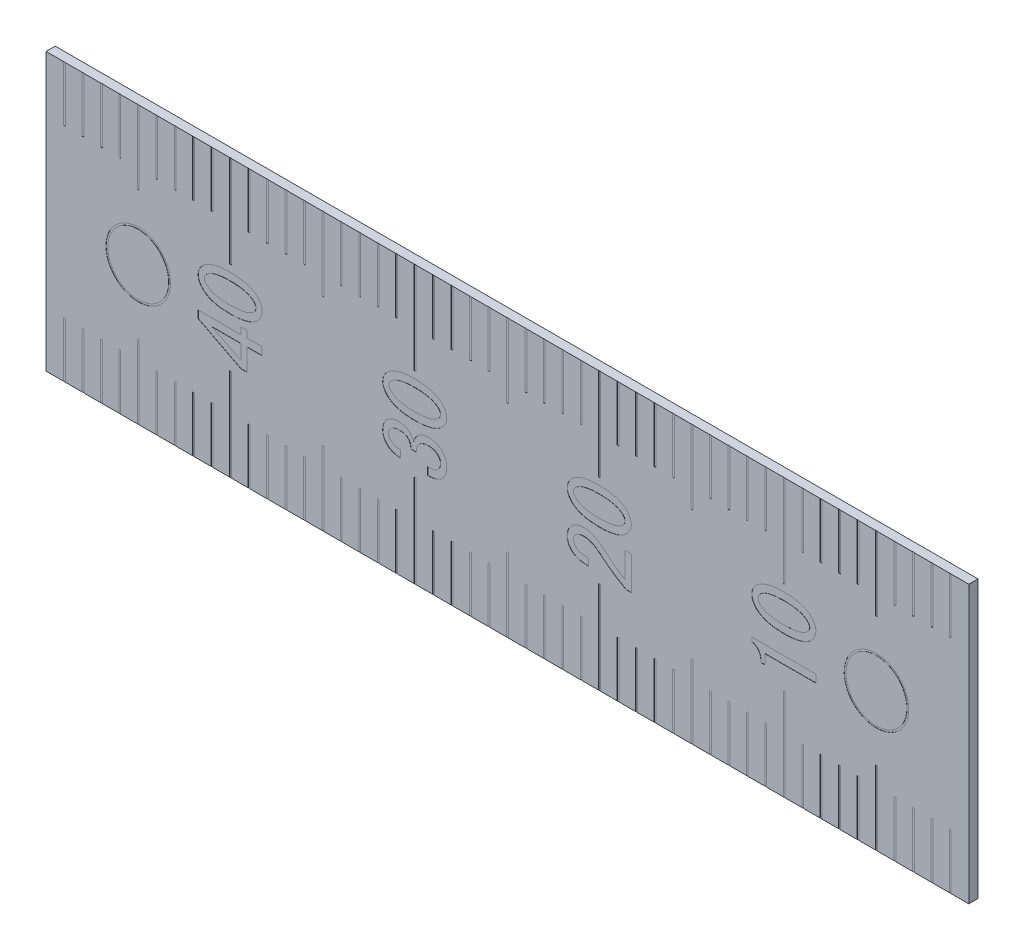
from build123d import *

# Parameters (mm, degrees)
SKETCH1_W             = 15
SKETCH1_H             = 50
EXTRUDE1_DEPTH        = 0.5
SKETCH2_R             = 1.75
SKETCH2_R_2           = 1.65
EXTRUDE2_DEPTH        = 0.01
EXTRUDE3_DEPTH        = 0.01
SKETCH4_W             = 5
SKETCH4_H             = 0.1
SKETCH4_W_2           = 3
SKETCH4_W_3           = 4
EXTRUDE4_DEPTH        = 0.01
BODY_MOVE_COPY2_ANGLE = 90


with BuildPart() as part:
    # Sketch1 → Extrude1 (new body)
    with BuildSketch(Plane.XY):
        with Locations((7.5, 25)):
            Rectangle(SKETCH1_W, SKETCH1_H)
    extrude(amount=EXTRUDE1_DEPTH)

    # Sketch2 → Extrude2 (cut)
    # profile 1 of 2: a face of its own
    with BuildSketch(Plane.XY.offset(0.5)):
        with Locations((7.5, 5)):
            Circle(SKETCH2_R)
        with Locations((7.5, 5)):
            Circle(SKETCH2_R_2, mode=Mode.SUBTRACT)
    # profile 2 of 2: a face of its own
    with BuildSketch(Plane.XY.offset(0.5)):
        with Locations((7.5, 45)):
            Circle(SKETCH2_R)
        with Locations((7.5, 45)):
            Circle(SKETCH2_R_2, mode=Mode.SUBTRACT)
    extrude(amount=-EXTRUDE2_DEPTH, mode=Mode.SUBTRACT)

    # Sketch3 → Extrude3 (cut)
    # profile 1 of 8: a face of its own
    with BuildSketch(Plane.XY.offset(0.5)):
        Polygon((6.572881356, 38.286911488), (6.572881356, 38.694915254), (6.572881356, 39.105555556), (5.392372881, 39.105555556), (5.392372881, 39.442372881), (6.584745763, 41.755932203), (6.994067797, 41.755932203), (6.994067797, 39.442372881), (7.36779661, 39.442372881), (7.36779661, 39.105555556), (6.994067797, 39.105555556), (6.994067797, 38.286911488), align=None)
        Polygon((6.572881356, 39.442372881), (6.572881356, 41.008474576), (5.783898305, 39.442372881), align=None, mode=Mode.SUBTRACT)
    # profile 2 of 8: a face of its own
    with BuildSketch(Plane.XY.offset(0.5)):
        with BuildLine():
            add(Edge.make_bspline(
                [(7.670338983, 40.029661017), (7.670829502, 40.072507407), (7.671793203, 40.156685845), (7.676090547, 40.280686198), (7.684705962, 40.399825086), (7.696795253, 40.514071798), (7.710795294, 40.623684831), (7.729370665, 40.728309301), (7.751095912, 40.828149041), (7.77597959, 40.922993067), (7.804365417, 41.012966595), (7.836057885, 41.098089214), (7.870573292, 41.178755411), (7.909950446, 41.253817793), (7.951116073, 41.324637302), (7.996213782, 41.390336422), (8.044897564, 41.450979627), (8.080073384, 41.488323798), (8.097457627, 41.506779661)],
                knots=[0, 0, 0, 0, 1.305427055, 2.564715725, 3.779397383, 4.943659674, 6.064530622, 7.145206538, 8.1798118, 9.17670212, 10.131464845, 11.052792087, 11.943155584, 12.802378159, 13.633530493, 14.437472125, 15.227783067, 16, 16, 16, 16], degree=3))
            add(Edge.make_bspline(
                [(8.097457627, 41.506779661), (8.118189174, 41.526742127), (8.158560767, 41.565616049), (8.223990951, 41.6159742), (8.29062965, 41.658865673), (8.358609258, 41.695138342), (8.429073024, 41.722269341), (8.501187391, 41.741138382), (8.574673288, 41.753722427), (8.624274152, 41.755194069), (8.649152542, 41.755932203)],
                knots=[0, 0, 0, 0, 1.110117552, 2.161788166, 3.18031983, 4.16653166, 5.130321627, 6.086809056, 7.040397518, 8, 8, 8, 8], degree=3))
            add(Edge.make_bspline(
                [(8.649152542, 41.755932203), (8.674030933, 41.755194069), (8.723631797, 41.753722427), (8.797117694, 41.741138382), (8.869232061, 41.722269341), (8.939695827, 41.695138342), (9.007675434, 41.658865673), (9.074314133, 41.6159742), (9.139744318, 41.565616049), (9.18011591, 41.526742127), (9.200847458, 41.506779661)],
                knots=[0, 0, 0, 0, 0.959602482, 1.913190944, 2.869678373, 3.83346834, 4.81968017, 5.838211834, 6.889882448, 8, 8, 8, 8], degree=3))
            add(Edge.make_bspline(
                [(9.200847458, 41.506779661), (9.218227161, 41.488321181), (9.253393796, 41.450971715), (9.302148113, 41.39036917), (9.347032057, 41.324417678), (9.389280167, 41.254207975), (9.427522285, 41.17853116), (9.462317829, 41.098126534), (9.493918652, 41.012955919), (9.522335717, 40.922996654), (9.547189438, 40.828145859), (9.569006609, 40.728318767), (9.587229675, 40.623619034), (9.602638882, 40.514179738), (9.613279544, 40.399768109), (9.622305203, 40.280696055), (9.626487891, 40.156683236), (9.62746749, 40.072506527), (9.627966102, 40.029661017)],
                knots=[0, 0, 0, 0, 0.772188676, 1.562470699, 2.366382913, 3.20092084, 4.057056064, 4.947386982, 5.868680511, 6.823408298, 7.82026214, 8.854829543, 9.935465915, 11.057194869, 12.220740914, 13.435378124, 14.694620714, 16, 16, 16, 16], degree=3))
            add(Edge.make_bspline(
                [(9.627966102, 40.029661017), (9.627467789, 39.985936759), (9.62649093, 39.900222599), (9.622328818, 39.774232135), (9.613247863, 39.653405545), (9.602616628, 39.537241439), (9.587362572, 39.426237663), (9.568912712, 39.320259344), (9.547201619, 39.219315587), (9.522309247, 39.123160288), (9.494041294, 39.032051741), (9.462303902, 38.946046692), (9.427521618, 38.864982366), (9.389289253, 38.788641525), (9.347004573, 38.717800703), (9.302346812, 38.651238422), (9.253373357, 38.590568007), (9.218220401, 38.553208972), (9.200847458, 38.534745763)],
                knots=[0, 0, 0, 0, 1.317726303, 2.583183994, 3.797878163, 4.968595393, 6.097857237, 7.173314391, 8.20962062, 9.208490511, 10.165515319, 11.083041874, 11.969809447, 12.822581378, 13.653772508, 14.454446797, 15.23617212, 16, 16, 16, 16], degree=3))
            add(Edge.make_bspline(
                [(9.200847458, 38.534745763), (9.180085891, 38.515033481), (9.139553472, 38.476549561), (9.074305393, 38.426244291), (9.007859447, 38.383179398), (8.939507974, 38.347848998), (8.869256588, 38.320526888), (8.797111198, 38.30171788), (8.723633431, 38.289118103), (8.674031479, 38.287648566), (8.649152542, 38.286911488)],
                knots=[0, 0, 0, 0, 1.105704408, 2.15864601, 3.178408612, 4.161898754, 5.126853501, 6.084496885, 7.039237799, 8, 8, 8, 8], degree=3))
            add(Edge.make_bspline(
                [(8.649152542, 38.286911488), (8.624273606, 38.287648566), (8.574671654, 38.289118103), (8.501193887, 38.30171788), (8.429048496, 38.320526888), (8.358797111, 38.347848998), (8.290445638, 38.383179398), (8.223999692, 38.426244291), (8.158751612, 38.476549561), (8.118219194, 38.515033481), (8.097457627, 38.534745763)],
                knots=[0, 0, 0, 0, 0.960762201, 1.915503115, 2.873146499, 3.838101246, 4.821591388, 5.84135399, 6.894295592, 8, 8, 8, 8], degree=3))
            add(Edge.make_bspline(
                [(8.097457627, 38.534745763), (8.080080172, 38.553206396), (8.044918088, 38.590560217), (7.996014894, 38.65127076), (7.951141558, 38.717581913), (7.909944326, 38.789029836), (7.870572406, 38.864759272), (7.836072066, 38.946083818), (7.804242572, 39.032041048), (7.77600611, 39.123163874), (7.751083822, 39.219312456), (7.729463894, 39.320268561), (7.71066559, 39.426173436), (7.696818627, 39.537347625), (7.684739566, 39.65334975), (7.67606663, 39.77424179), (7.671790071, 39.900220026), (7.67082916, 39.98593589), (7.670338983, 40.029661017)],
                knots=[0, 0, 0, 0, 0.763855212, 1.545608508, 2.346311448, 3.174176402, 4.029980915, 4.916780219, 5.834339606, 6.79139866, 7.790304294, 8.826647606, 9.902143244, 11.030571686, 12.201985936, 13.416723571, 14.682226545, 16, 16, 16, 16], degree=3))
        make_face()
        with BuildLine():
            add(Edge.make_bspline(
                [(9.218644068, 40.029661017), (9.218401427, 40.06811401), (9.217925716, 40.143502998), (9.213890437, 40.254274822), (9.207394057, 40.36043931), (9.19820924, 40.461995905), (9.186467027, 40.558736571), (9.171997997, 40.650645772), (9.154788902, 40.737919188), (9.135417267, 40.820493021), (9.112729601, 40.898295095), (9.087786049, 40.971360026), (9.060527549, 41.040128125), (9.029099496, 41.103353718), (8.996371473, 41.162419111), (8.960630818, 41.216569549), (8.922584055, 41.266432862), (8.894393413, 41.296304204), (8.880508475, 41.311016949)],
                knots=[0, 0, 0, 0, 1.361121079, 2.668545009, 3.923107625, 5.125754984, 6.277561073, 7.372066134, 8.418398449, 9.425734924, 10.373324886, 11.2857946, 12.158104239, 12.989405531, 13.783340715, 14.546945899, 15.284316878, 16, 16, 16, 16], degree=3))
            add(Edge.make_bspline(
                [(8.880508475, 41.311016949), (8.862804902, 41.327301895), (8.828895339, 41.358494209), (8.771271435, 41.392758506), (8.711034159, 41.414027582), (8.669751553, 41.416541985), (8.649152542, 41.41779661)],
                knots=[0, 0, 0, 0, 1.101426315, 2.109680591, 3.056776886, 4, 4, 4, 4], degree=3))
            add(Edge.make_bspline(
                [(8.649152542, 41.41779661), (8.628553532, 41.416541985), (8.587270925, 41.414027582), (8.52703365, 41.392758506), (8.469409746, 41.358494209), (8.435500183, 41.327301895), (8.41779661, 41.311016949)],
                knots=[0, 0, 0, 0, 0.943223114, 1.890319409, 2.898573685, 4, 4, 4, 4], degree=3))
            add(Edge.make_bspline(
                [(8.41779661, 41.311016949), (8.403943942, 41.295612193), (8.375924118, 41.264452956), (8.337429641, 41.213183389), (8.302154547, 41.157195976), (8.269141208, 41.096778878), (8.238105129, 41.032500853), (8.210344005, 40.963298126), (8.185591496, 40.889711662), (8.163077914, 40.811655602), (8.143495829, 40.72935949), (8.126232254, 40.642529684), (8.111958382, 40.551250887), (8.100069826, 40.455410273), (8.090947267, 40.355384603), (8.084385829, 40.25076225), (8.080392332, 40.141745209), (8.07990761, 40.067454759), (8.079661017, 40.029661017)],
                knots=[0, 0, 0, 0, 0.733849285, 1.48435867, 2.268363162, 3.076728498, 3.92289974, 4.796109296, 5.716889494, 6.672935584, 7.673739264, 8.713513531, 9.809147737, 10.946688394, 12.135070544, 13.36761715, 14.660829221, 16, 16, 16, 16], degree=3))
            add(Edge.make_bspline(
                [(8.079661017, 40.029661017), (8.079901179, 39.99032918), (8.080370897, 39.913402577), (8.084420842, 39.800434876), (8.090885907, 39.692511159), (8.100090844, 39.589417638), (8.111903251, 39.491150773), (8.126256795, 39.397688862), (8.14342239, 39.309080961), (8.163018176, 39.225467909), (8.185450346, 39.146714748), (8.21053616, 39.072812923), (8.237777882, 39.003387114), (8.269201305, 38.93949489), (8.301960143, 38.879799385), (8.3374802, 38.825046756), (8.375740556, 38.775105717), (8.403918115, 38.745225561), (8.41779661, 38.730508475)],
                knots=[0, 0, 0, 0, 1.374671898, 2.688632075, 3.950368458, 5.153146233, 6.305673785, 7.409137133, 8.457347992, 9.459453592, 10.409852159, 11.318084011, 12.186518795, 13.014240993, 13.804868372, 14.565269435, 15.2933419, 16, 16, 16, 16], degree=3))
            add(Edge.make_bspline(
                [(8.41779661, 38.730508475), (8.43545363, 38.714135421), (8.469192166, 38.68285025), (8.527371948, 38.649736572), (8.587110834, 38.627272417), (8.628524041, 38.624907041), (8.649152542, 38.623728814)],
                knots=[0, 0, 0, 0, 1.101932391, 2.105541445, 3.0563435, 4, 4, 4, 4], degree=3))
            add(Edge.make_bspline(
                [(8.649152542, 38.623728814), (8.669781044, 38.624907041), (8.711194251, 38.627272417), (8.770933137, 38.649736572), (8.829112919, 38.68285025), (8.862851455, 38.714135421), (8.880508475, 38.730508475)],
                knots=[0, 0, 0, 0, 0.9436565, 1.894458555, 2.898067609, 4, 4, 4, 4], degree=3))
            add(Edge.make_bspline(
                [(8.880508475, 38.730508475), (8.894386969, 38.745225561), (8.922564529, 38.775105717), (8.960824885, 38.825046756), (8.996344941, 38.879799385), (9.02910378, 38.93949489), (9.060527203, 39.003387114), (9.087768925, 39.072812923), (9.112854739, 39.146714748), (9.135286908, 39.225467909), (9.154882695, 39.309080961), (9.17204829, 39.397688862), (9.186401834, 39.491150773), (9.198214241, 39.589417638), (9.207419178, 39.692511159), (9.213884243, 39.800434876), (9.217934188, 39.913402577), (9.218403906, 39.99032918), (9.218644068, 40.029661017)],
                knots=[0, 0, 0, 0, 0.7066581, 1.434730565, 2.195131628, 2.985759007, 3.813481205, 4.681915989, 5.590147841, 6.540546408, 7.542652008, 8.590862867, 9.694326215, 10.846853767, 12.049631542, 13.311367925, 14.625328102, 16, 16, 16, 16], degree=3))
        make_face(mode=Mode.SUBTRACT)
    # profile 3 of 8: a face of its own
    with BuildSketch(Plane.XY.offset(0.5)):
        with BuildLine():
            add(Edge.make_bspline(
                [(5.855084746, 29.31779661), (5.854237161, 29.286380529), (5.852594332, 29.225488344), (5.856876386, 29.137276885), (5.868367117, 29.055815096), (5.884283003, 28.980780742), (5.907291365, 28.912297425), (5.937126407, 28.851010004), (5.972049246, 28.795439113), (6.000912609, 28.763950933), (6.015254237, 28.748305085)],
                knots=[0, 0, 0, 0, 1.239207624, 2.401892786, 3.477811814, 4.480626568, 5.423235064, 6.318453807, 7.164473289, 8, 8, 8, 8], degree=3))
            add(Edge.make_bspline(
                [(6.015254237, 28.748305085), (6.037095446, 28.728932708), (6.081015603, 28.689977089), (6.162748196, 28.65151788), (6.254479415, 28.62775036), (6.319389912, 28.625111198), (6.353389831, 28.623728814)],
                knots=[0, 0, 0, 0, 0.943344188, 1.896956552, 2.898432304, 4, 4, 4, 4], degree=3))
            add(Edge.make_bspline(
                [(6.353389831, 28.623728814), (6.382885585, 28.625600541), (6.442770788, 28.629400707), (6.530035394, 28.662470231), (6.615193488, 28.713031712), (6.665308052, 28.759558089), (6.691525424, 28.783898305)],
                knots=[0, 0, 0, 0, 0.919697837, 1.867261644, 2.884260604, 4, 4, 4, 4], degree=3))
            add(Edge.make_bspline(
                [(6.691525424, 28.783898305), (6.704506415, 28.798041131), (6.730947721, 28.826849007), (6.762873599, 28.87803764), (6.790850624, 28.93489513), (6.812875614, 28.998785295), (6.830852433, 29.069052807), (6.842953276, 29.14607081), (6.850175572, 29.229773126), (6.851175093, 29.287680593), (6.851694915, 29.31779661)],
                knots=[0, 0, 0, 0, 0.805009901, 1.639744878, 2.523230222, 3.463349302, 4.47308559, 5.567268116, 6.734805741, 8, 8, 8, 8], degree=3))
            add(Edge.make_bspline(
                [(6.851694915, 29.31779661), (6.851030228, 29.341116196), (6.849720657, 29.387060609), (6.840325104, 29.454392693), (6.825098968, 29.518830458), (6.80407704, 29.580614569), (6.776099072, 29.639452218), (6.742223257, 29.695639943), (6.702890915, 29.749647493), (6.671713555, 29.781952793), (6.655932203, 29.798305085)],
                knots=[0, 0, 0, 0, 1.049658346, 2.068044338, 3.05411714, 4.026954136, 5.00039438, 5.980894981, 6.977969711, 8, 8, 8, 8], degree=3))
            add(Edge.make_bspline(
                [(6.655932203, 29.798305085), (6.643689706, 29.809635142), (6.618997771, 29.832486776), (6.576319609, 29.860786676), (6.529139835, 29.884057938), (6.477383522, 29.901482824), (6.421623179, 29.914983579), (6.361288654, 29.922371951), (6.296502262, 29.92600955), (6.251882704, 29.923947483), (6.228813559, 29.922881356)],
                knots=[0, 0, 0, 0, 0.871605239, 1.757943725, 2.667896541, 3.616736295, 4.609341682, 5.664478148, 6.79249158, 8, 8, 8, 8], degree=3))
            Line((6.228813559, 29.922881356), (6.228813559, 30.225423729))
            add(Edge.make_bspline(
                [(6.228813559, 30.225423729), (6.251905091, 30.227382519), (6.296701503, 30.231182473), (6.361634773, 30.240642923), (6.421607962, 30.255530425), (6.477699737, 30.27292487), (6.528907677, 30.295554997), (6.57613528, 30.321174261), (6.618876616, 30.350763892), (6.643673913, 30.374071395), (6.655932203, 30.38559322)],
                knots=[0, 0, 0, 0, 1.193010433, 2.314380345, 3.373317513, 4.371301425, 5.333718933, 6.249965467, 7.134888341, 8, 8, 8, 8], degree=3))
            add(Edge.make_bspline(
                [(6.655932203, 30.38559322), (6.667527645, 30.397801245), (6.691022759, 30.422537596), (6.719260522, 30.465783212), (6.744475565, 30.512503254), (6.7636149, 30.564151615), (6.779886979, 30.620003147), (6.790583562, 30.680329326), (6.797465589, 30.745099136), (6.798018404, 30.789622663), (6.798305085, 30.812711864)],
                knots=[0, 0, 0, 0, 0.872621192, 1.768137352, 2.671468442, 3.624922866, 4.621628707, 5.689026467, 6.801565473, 8, 8, 8, 8], degree=3))
            add(Edge.make_bspline(
                [(6.798305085, 30.812711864), (6.797772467, 30.841289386), (6.796742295, 30.896563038), (6.789606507, 30.97655192), (6.777306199, 31.050680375), (6.759528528, 31.118580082), (6.737339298, 31.180667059), (6.709321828, 31.236148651), (6.677557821, 31.286558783), (6.651119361, 31.314896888), (6.638135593, 31.328813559)],
                knots=[0, 0, 0, 0, 1.237773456, 2.394058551, 3.475172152, 4.488524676, 5.430883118, 6.32465486, 7.177248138, 8, 8, 8, 8], degree=3))
            add(Edge.make_bspline(
                [(6.638135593, 31.328813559), (6.619858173, 31.345254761), (6.583764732, 31.377722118), (6.518584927, 31.411756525), (6.44688644, 31.432032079), (6.396808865, 31.434387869), (6.371186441, 31.43559322)],
                knots=[0, 0, 0, 0, 0.996207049, 1.967265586, 2.959941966, 4, 4, 4, 4], degree=3))
            add(Edge.make_bspline(
                [(6.371186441, 31.43559322), (6.345564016, 31.434387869), (6.295486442, 31.432032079), (6.223787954, 31.411756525), (6.158608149, 31.377722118), (6.122514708, 31.345254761), (6.104237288, 31.328813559)],
                knots=[0, 0, 0, 0, 1.040058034, 2.032734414, 3.003792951, 4, 4, 4, 4], degree=3))
            add(Edge.make_bspline(
                [(6.104237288, 31.328813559), (6.089776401, 31.313325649), (6.060656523, 31.282137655), (6.023858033, 31.228720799), (5.99197489, 31.170117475), (5.965103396, 31.105788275), (5.942469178, 31.036012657), (5.926581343, 30.960375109), (5.914425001, 30.879600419), (5.910499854, 30.823738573), (5.908474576, 30.794915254)],
                knots=[0, 0, 0, 0, 0.873425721, 1.758816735, 2.667665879, 3.622477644, 4.631783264, 5.6899558, 6.808074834, 8, 8, 8, 8], degree=3))
            Line((5.908474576, 30.794915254), (5.516949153, 30.794915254))
            add(Edge.make_bspline(
                [(5.516949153, 30.794915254), (5.519136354, 30.832553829), (5.523428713, 30.906419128), (5.541152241, 31.014153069), (5.565742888, 31.116659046), (5.599421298, 31.213425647), (5.641988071, 31.304205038), (5.692307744, 31.389733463), (5.750770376, 31.470197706), (5.796519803, 31.518246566), (5.819491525, 31.542372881)],
                knots=[0, 0, 0, 0, 1.094560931, 2.148064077, 3.166651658, 4.153716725, 5.118829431, 6.07444051, 7.0331372, 8, 8, 8, 8], degree=3))
            add(Edge.make_bspline(
                [(5.819491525, 31.542372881), (5.837606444, 31.559463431), (5.873568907, 31.593392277), (5.933236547, 31.637089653), (5.997087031, 31.673081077), (6.063953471, 31.704293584), (6.135510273, 31.726605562), (6.210503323, 31.744361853), (6.289639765, 31.75403117), (6.343699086, 31.755291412), (6.371186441, 31.755932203)],
                knots=[0, 0, 0, 0, 0.982869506, 1.951232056, 2.911200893, 3.87414517, 4.85919522, 5.865267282, 6.914559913, 8, 8, 8, 8], degree=3))
            add(Edge.make_bspline(
                [(6.371186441, 31.755932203), (6.400212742, 31.75530941), (6.45690343, 31.754093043), (6.539734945, 31.744312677), (6.617668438, 31.726841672), (6.691695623, 31.704105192), (6.760787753, 31.673425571), (6.826107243, 31.637226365), (6.886527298, 31.593587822), (6.922581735, 31.559488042), (6.940677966, 31.542372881)],
                knots=[0, 0, 0, 0, 1.1148228, 2.177338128, 3.197095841, 4.179355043, 5.146818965, 6.095248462, 7.043978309, 8, 8, 8, 8], degree=3))
            add(Edge.make_bspline(
                [(6.940677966, 31.542372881), (6.960789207, 31.521311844), (7.000715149, 31.479500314), (7.050703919, 31.408467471), (7.093629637, 31.333157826), (7.129597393, 31.253229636), (7.156749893, 31.167830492), (7.175324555, 31.077438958), (7.187735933, 30.982230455), (7.189122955, 30.917115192), (7.189830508, 30.883898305)],
                knots=[0, 0, 0, 0, 0.965213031, 1.916194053, 2.872998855, 3.839092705, 4.81906353, 5.840080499, 6.898172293, 8, 8, 8, 8], degree=3))
            add(Edge.make_bspline(
                [(7.189830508, 30.883898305), (7.189188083, 30.853553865), (7.187942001, 30.794696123), (7.178630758, 30.709388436), (7.163534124, 30.62978595), (7.142688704, 30.555442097), (7.114814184, 30.48659326), (7.081194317, 30.423115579), (7.041799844, 30.364749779), (7.009934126, 30.331141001), (6.994067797, 30.31440678)],
                knots=[0, 0, 0, 0, 1.177909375, 2.284737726, 3.326967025, 4.320553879, 5.277281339, 6.204541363, 7.106019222, 8, 8, 8, 8], degree=3))
            add(Edge.make_bspline(
                [(6.994067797, 30.31440678), (6.965346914, 30.286806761), (6.910623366, 30.23421886), (6.82464357, 30.168038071), (6.741089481, 30.116155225), (6.683328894, 30.093701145), (6.655932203, 30.083050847)],
                knots=[0, 0, 0, 0, 1.156237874, 2.20304646, 3.147678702, 4, 4, 4, 4], degree=3))
            add(Edge.make_bspline(
                [(6.655932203, 30.083050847), (6.692456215, 30.070797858), (6.762638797, 30.04725317), (6.859251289, 30.002078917), (6.942516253, 29.949298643), (6.989290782, 29.907473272), (7.011864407, 29.887288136)],
                knots=[0, 0, 0, 0, 1.127022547, 2.165626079, 3.114721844, 4, 4, 4, 4], degree=3))
            add(Edge.make_bspline(
                [(7.011864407, 29.887288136), (7.031906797, 29.866396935), (7.071315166, 29.82531959), (7.121385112, 29.75713319), (7.164478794, 29.686384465), (7.200684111, 29.612307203), (7.227428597, 29.534251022), (7.246538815, 29.452987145), (7.258829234, 29.368703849), (7.26028238, 29.311247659), (7.261016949, 29.28220339)],
                knots=[0, 0, 0, 0, 1.032403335, 2.029964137, 3.011802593, 3.986915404, 4.966590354, 5.950024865, 6.963731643, 8, 8, 8, 8], degree=3))
            add(Edge.make_bspline(
                [(7.261016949, 29.28220339), (7.260107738, 29.244595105), (7.258326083, 29.170899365), (7.245030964, 29.062972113), (7.222782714, 28.960785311), (7.191569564, 28.864018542), (7.151384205, 28.772986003), (7.102175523, 28.687259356), (7.044331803, 28.606956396), (6.999018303, 28.558879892), (6.976271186, 28.534745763)],
                knots=[0, 0, 0, 0, 1.098385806, 2.152354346, 3.170785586, 4.14905217, 5.117394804, 6.071856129, 7.032082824, 8, 8, 8, 8], degree=3))
            add(Edge.make_bspline(
                [(6.976271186, 28.534745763), (6.95539303, 28.51489658), (6.913980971, 28.475525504), (6.844715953, 28.425961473), (6.772751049, 28.382434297), (6.69643541, 28.347443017), (6.616257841, 28.320218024), (6.532036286, 28.301445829), (6.444059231, 28.289024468), (6.383973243, 28.287624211), (6.353389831, 28.286911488)],
                knots=[0, 0, 0, 0, 1.002941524, 1.989345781, 2.961196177, 3.930871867, 4.909217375, 5.906794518, 6.934570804, 8, 8, 8, 8], degree=3))
            add(Edge.make_bspline(
                [(6.353389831, 28.286911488), (6.320174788, 28.287384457), (6.255300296, 28.288308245), (6.161021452, 28.300136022), (6.072206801, 28.31739535), (5.989040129, 28.342792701), (5.911092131, 28.374810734), (5.838829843, 28.414630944), (5.772044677, 28.461543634), (5.732521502, 28.498450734), (5.712711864, 28.516949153)],
                knots=[0, 0, 0, 0, 1.139704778, 2.226032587, 3.257187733, 4.242744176, 5.206582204, 6.145174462, 7.070332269, 8, 8, 8, 8], degree=3))
            add(Edge.make_bspline(
                [(5.712711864, 28.516949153), (5.691201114, 28.540157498), (5.64795465, 28.586816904), (5.593991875, 28.667318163), (5.547688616, 28.755199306), (5.509997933, 28.851612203), (5.481332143, 28.9564097), (5.460323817, 29.069484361), (5.447736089, 29.190956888), (5.44643317, 29.27470259), (5.445762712, 29.31779661)],
                knots=[0, 0, 0, 0, 0.875500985, 1.760158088, 2.674977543, 3.623303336, 4.621607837, 5.680513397, 6.806434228, 8, 8, 8, 8], degree=3))
            Line((5.445762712, 29.31779661), (5.855084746, 29.31779661))
        make_face()
    # profile 4 of 8: a face of its own
    with BuildSketch(Plane.XY.offset(0.5)):
        with BuildLine():
            add(Edge.make_bspline(
                [(7.670338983, 30.029661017), (7.670829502, 30.072507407), (7.671793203, 30.156685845), (7.676090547, 30.280686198), (7.684705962, 30.399825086), (7.696795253, 30.514071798), (7.710795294, 30.623684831), (7.729370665, 30.728309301), (7.751095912, 30.828149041), (7.77597959, 30.922993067), (7.804365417, 31.012966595), (7.836057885, 31.098089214), (7.870573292, 31.178755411), (7.909950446, 31.253817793), (7.951116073, 31.324637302), (7.996213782, 31.390336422), (8.044897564, 31.450979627), (8.080073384, 31.488323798), (8.097457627, 31.506779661)],
                knots=[0, 0, 0, 0, 1.305427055, 2.564715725, 3.779397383, 4.943659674, 6.064530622, 7.145206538, 8.1798118, 9.17670212, 10.131464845, 11.052792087, 11.943155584, 12.802378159, 13.633530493, 14.437472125, 15.227783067, 16, 16, 16, 16], degree=3))
            add(Edge.make_bspline(
                [(8.097457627, 31.506779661), (8.118189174, 31.526742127), (8.158560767, 31.565616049), (8.223990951, 31.6159742), (8.29062965, 31.658865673), (8.358609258, 31.695138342), (8.429073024, 31.722269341), (8.501187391, 31.741138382), (8.574673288, 31.753722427), (8.624274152, 31.755194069), (8.649152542, 31.755932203)],
                knots=[0, 0, 0, 0, 1.110117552, 2.161788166, 3.18031983, 4.16653166, 5.130321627, 6.086809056, 7.040397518, 8, 8, 8, 8], degree=3))
            add(Edge.make_bspline(
                [(8.649152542, 31.755932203), (8.674030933, 31.755194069), (8.723631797, 31.753722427), (8.797117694, 31.741138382), (8.869232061, 31.722269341), (8.939695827, 31.695138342), (9.007675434, 31.658865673), (9.074314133, 31.6159742), (9.139744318, 31.565616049), (9.18011591, 31.526742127), (9.200847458, 31.506779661)],
                knots=[0, 0, 0, 0, 0.959602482, 1.913190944, 2.869678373, 3.83346834, 4.81968017, 5.838211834, 6.889882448, 8, 8, 8, 8], degree=3))
            add(Edge.make_bspline(
                [(9.200847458, 31.506779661), (9.218227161, 31.488321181), (9.253393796, 31.450971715), (9.302148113, 31.39036917), (9.347032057, 31.324417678), (9.389280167, 31.254207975), (9.427522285, 31.17853116), (9.462317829, 31.098126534), (9.493918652, 31.012955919), (9.522335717, 30.922996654), (9.547189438, 30.828145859), (9.569006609, 30.728318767), (9.587229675, 30.623619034), (9.602638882, 30.514179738), (9.613279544, 30.399768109), (9.622305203, 30.280696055), (9.626487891, 30.156683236), (9.62746749, 30.072506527), (9.627966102, 30.029661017)],
                knots=[0, 0, 0, 0, 0.772188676, 1.562470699, 2.366382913, 3.20092084, 4.057056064, 4.947386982, 5.868680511, 6.823408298, 7.82026214, 8.854829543, 9.935465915, 11.057194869, 12.220740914, 13.435378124, 14.694620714, 16, 16, 16, 16], degree=3))
            add(Edge.make_bspline(
                [(9.627966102, 30.029661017), (9.627467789, 29.985936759), (9.62649093, 29.900222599), (9.622328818, 29.774232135), (9.613247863, 29.653405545), (9.602616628, 29.537241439), (9.587362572, 29.426237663), (9.568912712, 29.320259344), (9.547201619, 29.219315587), (9.522309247, 29.123160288), (9.494041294, 29.032051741), (9.462303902, 28.946046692), (9.427521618, 28.864982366), (9.389289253, 28.788641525), (9.347004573, 28.717800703), (9.302346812, 28.651238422), (9.253373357, 28.590568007), (9.218220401, 28.553208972), (9.200847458, 28.534745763)],
                knots=[0, 0, 0, 0, 1.317726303, 2.583183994, 3.797878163, 4.968595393, 6.097857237, 7.173314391, 8.20962062, 9.208490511, 10.165515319, 11.083041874, 11.969809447, 12.822581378, 13.653772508, 14.454446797, 15.23617212, 16, 16, 16, 16], degree=3))
            add(Edge.make_bspline(
                [(9.200847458, 28.534745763), (9.180085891, 28.515033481), (9.139553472, 28.476549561), (9.074305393, 28.426244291), (9.007859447, 28.383179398), (8.939507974, 28.347848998), (8.869256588, 28.320526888), (8.797111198, 28.30171788), (8.723633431, 28.289118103), (8.674031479, 28.287648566), (8.649152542, 28.286911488)],
                knots=[0, 0, 0, 0, 1.105704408, 2.15864601, 3.178408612, 4.161898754, 5.126853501, 6.084496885, 7.039237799, 8, 8, 8, 8], degree=3))
            add(Edge.make_bspline(
                [(8.649152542, 28.286911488), (8.624273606, 28.287648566), (8.574671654, 28.289118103), (8.501193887, 28.30171788), (8.429048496, 28.320526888), (8.358797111, 28.347848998), (8.290445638, 28.383179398), (8.223999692, 28.426244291), (8.158751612, 28.476549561), (8.118219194, 28.515033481), (8.097457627, 28.534745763)],
                knots=[0, 0, 0, 0, 0.960762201, 1.915503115, 2.873146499, 3.838101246, 4.821591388, 5.84135399, 6.894295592, 8, 8, 8, 8], degree=3))
            add(Edge.make_bspline(
                [(8.097457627, 28.534745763), (8.080080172, 28.553206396), (8.044918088, 28.590560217), (7.996014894, 28.65127076), (7.951141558, 28.717581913), (7.909944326, 28.789029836), (7.870572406, 28.864759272), (7.836072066, 28.946083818), (7.804242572, 29.032041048), (7.77600611, 29.123163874), (7.751083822, 29.219312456), (7.729463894, 29.320268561), (7.71066559, 29.426173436), (7.696818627, 29.537347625), (7.684739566, 29.65334975), (7.67606663, 29.77424179), (7.671790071, 29.900220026), (7.67082916, 29.98593589), (7.670338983, 30.029661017)],
                knots=[0, 0, 0, 0, 0.763855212, 1.545608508, 2.346311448, 3.174176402, 4.029980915, 4.916780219, 5.834339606, 6.79139866, 7.790304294, 8.826647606, 9.902143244, 11.030571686, 12.201985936, 13.416723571, 14.682226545, 16, 16, 16, 16], degree=3))
        make_face()
        with BuildLine():
            add(Edge.make_bspline(
                [(9.218644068, 30.029661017), (9.218401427, 30.06811401), (9.217925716, 30.143502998), (9.213890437, 30.254274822), (9.207394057, 30.36043931), (9.19820924, 30.461995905), (9.186467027, 30.558736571), (9.171997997, 30.650645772), (9.154788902, 30.737919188), (9.135417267, 30.820493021), (9.112729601, 30.898295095), (9.087786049, 30.971360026), (9.060527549, 31.040128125), (9.029099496, 31.103353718), (8.996371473, 31.162419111), (8.960630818, 31.216569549), (8.922584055, 31.266432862), (8.894393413, 31.296304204), (8.880508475, 31.311016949)],
                knots=[0, 0, 0, 0, 1.361121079, 2.668545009, 3.923107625, 5.125754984, 6.277561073, 7.372066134, 8.418398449, 9.425734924, 10.373324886, 11.2857946, 12.158104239, 12.989405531, 13.783340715, 14.546945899, 15.284316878, 16, 16, 16, 16], degree=3))
            add(Edge.make_bspline(
                [(8.880508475, 31.311016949), (8.862804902, 31.327301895), (8.828895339, 31.358494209), (8.771271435, 31.392758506), (8.711034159, 31.414027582), (8.669751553, 31.416541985), (8.649152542, 31.41779661)],
                knots=[0, 0, 0, 0, 1.101426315, 2.109680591, 3.056776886, 4, 4, 4, 4], degree=3))
            add(Edge.make_bspline(
                [(8.649152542, 31.41779661), (8.628553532, 31.416541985), (8.587270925, 31.414027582), (8.52703365, 31.392758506), (8.469409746, 31.358494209), (8.435500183, 31.327301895), (8.41779661, 31.311016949)],
                knots=[0, 0, 0, 0, 0.943223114, 1.890319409, 2.898573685, 4, 4, 4, 4], degree=3))
            add(Edge.make_bspline(
                [(8.41779661, 31.311016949), (8.403943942, 31.295612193), (8.375924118, 31.264452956), (8.337429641, 31.213183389), (8.302154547, 31.157195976), (8.269141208, 31.096778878), (8.238105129, 31.032500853), (8.210344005, 30.963298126), (8.185591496, 30.889711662), (8.163077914, 30.811655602), (8.143495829, 30.72935949), (8.126232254, 30.642529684), (8.111958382, 30.551250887), (8.100069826, 30.455410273), (8.090947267, 30.355384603), (8.084385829, 30.25076225), (8.080392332, 30.141745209), (8.07990761, 30.067454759), (8.079661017, 30.029661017)],
                knots=[0, 0, 0, 0, 0.733849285, 1.48435867, 2.268363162, 3.076728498, 3.92289974, 4.796109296, 5.716889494, 6.672935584, 7.673739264, 8.713513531, 9.809147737, 10.946688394, 12.135070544, 13.36761715, 14.660829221, 16, 16, 16, 16], degree=3))
            add(Edge.make_bspline(
                [(8.079661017, 30.029661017), (8.079901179, 29.99032918), (8.080370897, 29.913402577), (8.084420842, 29.800434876), (8.090885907, 29.692511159), (8.100090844, 29.589417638), (8.111903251, 29.491150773), (8.126256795, 29.397688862), (8.14342239, 29.309080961), (8.163018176, 29.225467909), (8.185450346, 29.146714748), (8.21053616, 29.072812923), (8.237777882, 29.003387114), (8.269201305, 28.93949489), (8.301960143, 28.879799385), (8.3374802, 28.825046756), (8.375740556, 28.775105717), (8.403918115, 28.745225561), (8.41779661, 28.730508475)],
                knots=[0, 0, 0, 0, 1.374671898, 2.688632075, 3.950368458, 5.153146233, 6.305673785, 7.409137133, 8.457347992, 9.459453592, 10.409852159, 11.318084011, 12.186518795, 13.014240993, 13.804868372, 14.565269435, 15.2933419, 16, 16, 16, 16], degree=3))
            add(Edge.make_bspline(
                [(8.41779661, 28.730508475), (8.43545363, 28.714135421), (8.469192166, 28.68285025), (8.527371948, 28.649736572), (8.587110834, 28.627272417), (8.628524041, 28.624907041), (8.649152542, 28.623728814)],
                knots=[0, 0, 0, 0, 1.101932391, 2.105541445, 3.0563435, 4, 4, 4, 4], degree=3))
            add(Edge.make_bspline(
                [(8.649152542, 28.623728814), (8.669781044, 28.624907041), (8.711194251, 28.627272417), (8.770933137, 28.649736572), (8.829112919, 28.68285025), (8.862851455, 28.714135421), (8.880508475, 28.730508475)],
                knots=[0, 0, 0, 0, 0.9436565, 1.894458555, 2.898067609, 4, 4, 4, 4], degree=3))
            add(Edge.make_bspline(
                [(8.880508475, 28.730508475), (8.894386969, 28.745225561), (8.922564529, 28.775105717), (8.960824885, 28.825046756), (8.996344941, 28.879799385), (9.02910378, 28.93949489), (9.060527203, 29.003387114), (9.087768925, 29.072812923), (9.112854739, 29.146714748), (9.135286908, 29.225467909), (9.154882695, 29.309080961), (9.17204829, 29.397688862), (9.186401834, 29.491150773), (9.198214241, 29.589417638), (9.207419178, 29.692511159), (9.213884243, 29.800434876), (9.217934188, 29.913402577), (9.218403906, 29.99032918), (9.218644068, 30.029661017)],
                knots=[0, 0, 0, 0, 0.7066581, 1.434730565, 2.195131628, 2.985759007, 3.813481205, 4.681915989, 5.590147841, 6.540546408, 7.542652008, 8.590862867, 9.694326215, 10.846853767, 12.049631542, 13.311367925, 14.625328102, 16, 16, 16, 16], degree=3))
        make_face(mode=Mode.SUBTRACT)
    # profile 5 of 8: a face of its own
    with BuildSketch(Plane.XY.offset(0.5)):
        with BuildLine():
            Line((7.278813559, 18.623728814), (7.278813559, 18.286911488))
            Line((7.278813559, 18.286911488), (5.463559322, 18.286911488))
            Line((5.463559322, 18.286911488), (5.463559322, 18.570338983))
            add(Edge.make_bspline(
                [(5.463559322, 18.570338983), (5.498324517, 18.634054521), (5.567960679, 18.761679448), (5.6797878, 18.949763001), (5.797762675, 19.135242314), (5.921134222, 19.319023), (6.051060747, 19.500356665), (6.187539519, 19.679151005), (6.329169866, 19.856558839), (6.428173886, 19.971735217), (6.477966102, 20.029661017)],
                knots=[0, 0, 0, 0, 0.978031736, 1.959039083, 2.947962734, 3.93993095, 4.941489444, 5.953491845, 6.970747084, 8, 8, 8, 8], degree=3))
            add(Edge.make_bspline(
                [(6.477966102, 20.029661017), (6.504874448, 20.061981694), (6.557570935, 20.125277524), (6.625963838, 20.22552891), (6.685342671, 20.326165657), (6.73277714, 20.428761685), (6.770085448, 20.531939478), (6.79666245, 20.636312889), (6.813029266, 20.741883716), (6.815078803, 20.81287462), (6.816101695, 20.848305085)],
                knots=[0, 0, 0, 0, 1.114457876, 2.182520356, 3.213612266, 4.209190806, 5.174713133, 6.118499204, 7.060971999, 8, 8, 8, 8], degree=3))
            add(Edge.make_bspline(
                [(6.816101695, 20.848305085), (6.815559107, 20.872710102), (6.814500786, 20.920312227), (6.807348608, 20.989563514), (6.795005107, 21.054485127), (6.777072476, 21.114656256), (6.754722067, 21.170714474), (6.726863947, 21.222057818), (6.694761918, 21.269704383), (6.668847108, 21.297276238), (6.655932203, 21.311016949)],
                knots=[0, 0, 0, 0, 1.165236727, 2.272800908, 3.320045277, 4.315844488, 5.266523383, 6.195893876, 7.100905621, 8, 8, 8, 8], degree=3))
            add(Edge.make_bspline(
                [(6.655932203, 21.311016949), (6.637239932, 21.327523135), (6.599842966, 21.360546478), (6.531033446, 21.394311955), (6.453848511, 21.414407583), (6.399440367, 21.416638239), (6.371186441, 21.41779661)],
                knots=[0, 0, 0, 0, 0.955281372, 1.911197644, 2.915293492, 4, 4, 4, 4], degree=3))
            add(Edge.make_bspline(
                [(6.371186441, 21.41779661), (6.347195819, 21.416178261), (6.297727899, 21.412841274), (6.225461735, 21.382877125), (6.152812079, 21.338256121), (6.109457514, 21.297213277), (6.086440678, 21.275423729)],
                knots=[0, 0, 0, 0, 0.878616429, 1.811679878, 2.838226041, 4, 4, 4, 4], degree=3))
            add(Edge.make_bspline(
                [(6.086440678, 21.275423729), (6.073340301, 21.260682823), (6.045878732, 21.229782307), (6.014541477, 21.172297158), (5.986374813, 21.105787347), (5.964776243, 21.028130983), (5.94696429, 20.940279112), (5.93484749, 20.841778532), (5.927790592, 20.732841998), (5.926792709, 20.656728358), (5.926271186, 20.616949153)],
                knots=[0, 0, 0, 0, 0.681736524, 1.429085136, 2.255271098, 3.183361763, 4.217126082, 5.361292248, 6.620934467, 8, 8, 8, 8], degree=3))
            Line((5.926271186, 20.616949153), (5.534745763, 20.616949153))
            add(Edge.make_bspline(
                [(5.534745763, 20.616949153), (5.536884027, 20.66863478), (5.541007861, 20.768315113), (5.558612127, 20.912051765), (5.583001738, 21.044849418), (5.616433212, 21.166713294), (5.65853644, 21.277386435), (5.708899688, 21.377100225), (5.76680797, 21.466726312), (5.814114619, 21.517500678), (5.837288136, 21.542372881)],
                knots=[0, 0, 0, 0, 1.245503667, 2.402064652, 3.484583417, 4.495008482, 5.441434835, 6.331296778, 7.18257321, 8, 8, 8, 8], degree=3))
            add(Edge.make_bspline(
                [(5.837288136, 21.542372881), (5.855355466, 21.559530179), (5.891481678, 21.59383675), (5.952345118, 21.636812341), (6.017267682, 21.673649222), (6.086296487, 21.704053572), (6.160486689, 21.726963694), (6.23848039, 21.744157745), (6.321272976, 21.754149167), (6.377750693, 21.755326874), (6.406779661, 21.755932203)],
                knots=[0, 0, 0, 0, 0.956098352, 1.911749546, 2.852903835, 3.820445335, 4.802783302, 5.830866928, 6.885087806, 8, 8, 8, 8], degree=3))
            add(Edge.make_bspline(
                [(6.406779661, 21.755932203), (6.434511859, 21.755465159), (6.488898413, 21.754549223), (6.568647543, 21.742396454), (6.645518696, 21.725279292), (6.718634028, 21.699145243), (6.788555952, 21.666787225), (6.854994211, 21.626731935), (6.918272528, 21.579565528), (6.956845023, 21.542994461), (6.976271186, 21.524576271)],
                knots=[0, 0, 0, 0, 1.052697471, 2.0644807, 3.058754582, 4.040933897, 5.00824168, 5.981797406, 6.983577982, 8, 8, 8, 8], degree=3))
            add(Edge.make_bspline(
                [(6.976271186, 21.524576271), (6.996442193, 21.503333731), (7.036747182, 21.460887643), (7.086228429, 21.387922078), (7.129704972, 21.310266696), (7.165542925, 21.226217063), (7.192177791, 21.135640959), (7.211123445, 21.039204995), (7.223336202, 20.93694094), (7.224716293, 20.866577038), (7.225423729, 20.830508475)],
                knots=[0, 0, 0, 0, 0.926985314, 1.852269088, 2.78426235, 3.745226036, 4.741005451, 5.770682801, 6.857251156, 8, 8, 8, 8], degree=3))
            add(Edge.make_bspline(
                [(7.225423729, 20.830508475), (7.224123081, 20.78711896), (7.22149698, 20.699512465), (7.196723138, 20.568153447), (7.15916462, 20.435936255), (7.106444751, 20.302352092), (7.03809091, 20.168153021), (6.955017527, 20.032587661), (6.857509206, 19.895754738), (6.783147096, 19.80788724), (6.744915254, 19.762711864)],
                knots=[0, 0, 0, 0, 0.869828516, 1.756245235, 2.673055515, 3.625149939, 4.632616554, 5.691117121, 6.812932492, 8, 8, 8, 8], degree=3))
            add(Edge.make_bspline(
                [(6.744915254, 19.762711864), (6.702546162, 19.714094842), (6.618868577, 19.618077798), (6.498015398, 19.472973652), (6.383790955, 19.32848106), (6.273558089, 19.186027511), (6.170111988, 19.043752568), (6.070683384, 18.903421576), (5.977731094, 18.76382659), (5.919441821, 18.670019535), (5.890677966, 18.623728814)],
                knots=[0, 0, 0, 0, 1.085774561, 2.144369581, 3.179090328, 4.186843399, 5.176841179, 6.140565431, 7.082429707, 8, 8, 8, 8], degree=3))
            Line((5.890677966, 18.623728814), (7.278813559, 18.623728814))
        make_face()
    # profile 6 of 8: a face of its own
    with BuildSketch(Plane.XY.offset(0.5)):
        with BuildLine():
            add(Edge.make_bspline(
                [(7.670338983, 20.029661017), (7.670829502, 20.072507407), (7.671793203, 20.156685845), (7.676090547, 20.280686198), (7.684705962, 20.399825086), (7.696795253, 20.514071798), (7.710795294, 20.623684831), (7.729370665, 20.728309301), (7.751095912, 20.828149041), (7.77597959, 20.922993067), (7.804365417, 21.012966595), (7.836057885, 21.098089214), (7.870573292, 21.178755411), (7.909950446, 21.253817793), (7.951116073, 21.324637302), (7.996213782, 21.390336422), (8.044897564, 21.450979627), (8.080073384, 21.488323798), (8.097457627, 21.506779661)],
                knots=[0, 0, 0, 0, 1.305427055, 2.564715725, 3.779397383, 4.943659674, 6.064530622, 7.145206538, 8.1798118, 9.17670212, 10.131464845, 11.052792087, 11.943155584, 12.802378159, 13.633530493, 14.437472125, 15.227783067, 16, 16, 16, 16], degree=3))
            add(Edge.make_bspline(
                [(8.097457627, 21.506779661), (8.118189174, 21.526742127), (8.158560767, 21.565616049), (8.223990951, 21.6159742), (8.29062965, 21.658865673), (8.358609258, 21.695138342), (8.429073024, 21.722269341), (8.501187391, 21.741138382), (8.574673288, 21.753722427), (8.624274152, 21.755194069), (8.649152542, 21.755932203)],
                knots=[0, 0, 0, 0, 1.110117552, 2.161788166, 3.18031983, 4.16653166, 5.130321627, 6.086809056, 7.040397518, 8, 8, 8, 8], degree=3))
            add(Edge.make_bspline(
                [(8.649152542, 21.755932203), (8.674030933, 21.755194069), (8.723631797, 21.753722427), (8.797117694, 21.741138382), (8.869232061, 21.722269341), (8.939695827, 21.695138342), (9.007675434, 21.658865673), (9.074314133, 21.6159742), (9.139744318, 21.565616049), (9.18011591, 21.526742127), (9.200847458, 21.506779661)],
                knots=[0, 0, 0, 0, 0.959602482, 1.913190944, 2.869678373, 3.83346834, 4.81968017, 5.838211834, 6.889882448, 8, 8, 8, 8], degree=3))
            add(Edge.make_bspline(
                [(9.200847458, 21.506779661), (9.218227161, 21.488321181), (9.253393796, 21.450971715), (9.302148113, 21.39036917), (9.347032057, 21.324417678), (9.389280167, 21.254207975), (9.427522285, 21.17853116), (9.462317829, 21.098126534), (9.493918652, 21.012955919), (9.522335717, 20.922996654), (9.547189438, 20.828145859), (9.569006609, 20.728318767), (9.587229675, 20.623619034), (9.602638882, 20.514179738), (9.613279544, 20.399768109), (9.622305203, 20.280696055), (9.626487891, 20.156683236), (9.62746749, 20.072506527), (9.627966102, 20.029661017)],
                knots=[0, 0, 0, 0, 0.772188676, 1.562470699, 2.366382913, 3.20092084, 4.057056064, 4.947386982, 5.868680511, 6.823408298, 7.82026214, 8.854829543, 9.935465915, 11.057194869, 12.220740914, 13.435378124, 14.694620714, 16, 16, 16, 16], degree=3))
            add(Edge.make_bspline(
                [(9.627966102, 20.029661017), (9.627467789, 19.985936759), (9.62649093, 19.900222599), (9.622328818, 19.774232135), (9.613247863, 19.653405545), (9.602616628, 19.537241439), (9.587362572, 19.426237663), (9.568912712, 19.320259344), (9.547201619, 19.219315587), (9.522309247, 19.123160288), (9.494041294, 19.032051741), (9.462303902, 18.946046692), (9.427521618, 18.864982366), (9.389289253, 18.788641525), (9.347004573, 18.717800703), (9.302346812, 18.651238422), (9.253373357, 18.590568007), (9.218220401, 18.553208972), (9.200847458, 18.534745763)],
                knots=[0, 0, 0, 0, 1.317726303, 2.583183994, 3.797878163, 4.968595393, 6.097857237, 7.173314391, 8.20962062, 9.208490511, 10.165515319, 11.083041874, 11.969809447, 12.822581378, 13.653772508, 14.454446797, 15.23617212, 16, 16, 16, 16], degree=3))
            add(Edge.make_bspline(
                [(9.200847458, 18.534745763), (9.180085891, 18.515033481), (9.139553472, 18.476549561), (9.074305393, 18.426244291), (9.007859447, 18.383179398), (8.939507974, 18.347848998), (8.869256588, 18.320526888), (8.797111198, 18.30171788), (8.723633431, 18.289118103), (8.674031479, 18.287648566), (8.649152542, 18.286911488)],
                knots=[0, 0, 0, 0, 1.105704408, 2.15864601, 3.178408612, 4.161898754, 5.126853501, 6.084496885, 7.039237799, 8, 8, 8, 8], degree=3))
            add(Edge.make_bspline(
                [(8.649152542, 18.286911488), (8.624273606, 18.287648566), (8.574671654, 18.289118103), (8.501193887, 18.30171788), (8.429048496, 18.320526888), (8.358797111, 18.347848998), (8.290445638, 18.383179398), (8.223999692, 18.426244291), (8.158751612, 18.476549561), (8.118219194, 18.515033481), (8.097457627, 18.534745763)],
                knots=[0, 0, 0, 0, 0.960762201, 1.915503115, 2.873146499, 3.838101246, 4.821591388, 5.84135399, 6.894295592, 8, 8, 8, 8], degree=3))
            add(Edge.make_bspline(
                [(8.097457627, 18.534745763), (8.080080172, 18.553206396), (8.044918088, 18.590560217), (7.996014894, 18.65127076), (7.951141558, 18.717581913), (7.909944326, 18.789029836), (7.870572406, 18.864759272), (7.836072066, 18.946083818), (7.804242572, 19.032041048), (7.77600611, 19.123163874), (7.751083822, 19.219312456), (7.729463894, 19.320268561), (7.71066559, 19.426173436), (7.696818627, 19.537347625), (7.684739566, 19.65334975), (7.67606663, 19.77424179), (7.671790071, 19.900220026), (7.67082916, 19.98593589), (7.670338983, 20.029661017)],
                knots=[0, 0, 0, 0, 0.763855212, 1.545608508, 2.346311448, 3.174176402, 4.029980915, 4.916780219, 5.834339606, 6.79139866, 7.790304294, 8.826647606, 9.902143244, 11.030571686, 12.201985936, 13.416723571, 14.682226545, 16, 16, 16, 16], degree=3))
        make_face()
        with BuildLine():
            add(Edge.make_bspline(
                [(9.218644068, 20.029661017), (9.218401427, 20.06811401), (9.217925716, 20.143502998), (9.213890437, 20.254274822), (9.207394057, 20.36043931), (9.19820924, 20.461995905), (9.186467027, 20.558736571), (9.171997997, 20.650645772), (9.154788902, 20.737919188), (9.135417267, 20.820493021), (9.112729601, 20.898295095), (9.087786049, 20.971360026), (9.060527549, 21.040128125), (9.029099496, 21.103353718), (8.996371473, 21.162419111), (8.960630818, 21.216569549), (8.922584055, 21.266432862), (8.894393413, 21.296304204), (8.880508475, 21.311016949)],
                knots=[0, 0, 0, 0, 1.361121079, 2.668545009, 3.923107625, 5.125754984, 6.277561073, 7.372066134, 8.418398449, 9.425734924, 10.373324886, 11.2857946, 12.158104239, 12.989405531, 13.783340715, 14.546945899, 15.284316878, 16, 16, 16, 16], degree=3))
            add(Edge.make_bspline(
                [(8.880508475, 21.311016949), (8.862804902, 21.327301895), (8.828895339, 21.358494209), (8.771271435, 21.392758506), (8.711034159, 21.414027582), (8.669751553, 21.416541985), (8.649152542, 21.41779661)],
                knots=[0, 0, 0, 0, 1.101426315, 2.109680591, 3.056776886, 4, 4, 4, 4], degree=3))
            add(Edge.make_bspline(
                [(8.649152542, 21.41779661), (8.628553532, 21.416541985), (8.587270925, 21.414027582), (8.52703365, 21.392758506), (8.469409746, 21.358494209), (8.435500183, 21.327301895), (8.41779661, 21.311016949)],
                knots=[0, 0, 0, 0, 0.943223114, 1.890319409, 2.898573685, 4, 4, 4, 4], degree=3))
            add(Edge.make_bspline(
                [(8.41779661, 21.311016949), (8.403943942, 21.295612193), (8.375924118, 21.264452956), (8.337429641, 21.213183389), (8.302154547, 21.157195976), (8.269141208, 21.096778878), (8.238105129, 21.032500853), (8.210344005, 20.963298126), (8.185591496, 20.889711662), (8.163077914, 20.811655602), (8.143495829, 20.72935949), (8.126232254, 20.642529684), (8.111958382, 20.551250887), (8.100069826, 20.455410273), (8.090947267, 20.355384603), (8.084385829, 20.25076225), (8.080392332, 20.141745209), (8.07990761, 20.067454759), (8.079661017, 20.029661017)],
                knots=[0, 0, 0, 0, 0.733849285, 1.48435867, 2.268363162, 3.076728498, 3.92289974, 4.796109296, 5.716889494, 6.672935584, 7.673739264, 8.713513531, 9.809147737, 10.946688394, 12.135070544, 13.36761715, 14.660829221, 16, 16, 16, 16], degree=3))
            add(Edge.make_bspline(
                [(8.079661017, 20.029661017), (8.079901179, 19.99032918), (8.080370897, 19.913402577), (8.084420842, 19.800434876), (8.090885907, 19.692511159), (8.100090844, 19.589417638), (8.111903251, 19.491150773), (8.126256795, 19.397688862), (8.14342239, 19.309080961), (8.163018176, 19.225467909), (8.185450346, 19.146714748), (8.21053616, 19.072812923), (8.237777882, 19.003387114), (8.269201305, 18.93949489), (8.301960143, 18.879799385), (8.3374802, 18.825046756), (8.375740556, 18.775105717), (8.403918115, 18.745225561), (8.41779661, 18.730508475)],
                knots=[0, 0, 0, 0, 1.374671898, 2.688632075, 3.950368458, 5.153146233, 6.305673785, 7.409137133, 8.457347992, 9.459453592, 10.409852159, 11.318084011, 12.186518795, 13.014240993, 13.804868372, 14.565269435, 15.2933419, 16, 16, 16, 16], degree=3))
            add(Edge.make_bspline(
                [(8.41779661, 18.730508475), (8.43545363, 18.714135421), (8.469192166, 18.68285025), (8.527371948, 18.649736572), (8.587110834, 18.627272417), (8.628524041, 18.624907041), (8.649152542, 18.623728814)],
                knots=[0, 0, 0, 0, 1.101932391, 2.105541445, 3.0563435, 4, 4, 4, 4], degree=3))
            add(Edge.make_bspline(
                [(8.649152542, 18.623728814), (8.669781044, 18.624907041), (8.711194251, 18.627272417), (8.770933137, 18.649736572), (8.829112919, 18.68285025), (8.862851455, 18.714135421), (8.880508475, 18.730508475)],
                knots=[0, 0, 0, 0, 0.9436565, 1.894458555, 2.898067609, 4, 4, 4, 4], degree=3))
            add(Edge.make_bspline(
                [(8.880508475, 18.730508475), (8.894386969, 18.745225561), (8.922564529, 18.775105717), (8.960824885, 18.825046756), (8.996344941, 18.879799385), (9.02910378, 18.93949489), (9.060527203, 19.003387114), (9.087768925, 19.072812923), (9.112854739, 19.146714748), (9.135286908, 19.225467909), (9.154882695, 19.309080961), (9.17204829, 19.397688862), (9.186401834, 19.491150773), (9.198214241, 19.589417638), (9.207419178, 19.692511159), (9.213884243, 19.800434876), (9.217934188, 19.913402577), (9.218403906, 19.99032918), (9.218644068, 20.029661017)],
                knots=[0, 0, 0, 0, 0.7066581, 1.434730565, 2.195131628, 2.985759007, 3.813481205, 4.681915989, 5.590147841, 6.540546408, 7.542652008, 8.590862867, 9.694326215, 10.846853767, 12.049631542, 13.311367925, 14.625328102, 16, 16, 16, 16], degree=3))
        make_face(mode=Mode.SUBTRACT)
    # profile 7 of 8: a face of its own
    with BuildSketch(Plane.XY.offset(0.5)):
        with BuildLine():
            Line((6.216949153, 8.286911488), (6.216949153, 9.673728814))
            Line((6.216949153, 9.673728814), (6.216949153, 11.047363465))
            Line((6.216949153, 11.047363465), (5.694915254, 11.047363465))
            Line((5.694915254, 11.047363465), (5.694915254, 11.257627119))
            add(Edge.make_bspline(
                [(5.694915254, 11.257627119), (5.720192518, 11.257994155), (5.769501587, 11.258710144), (5.841506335, 11.264639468), (5.909427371, 11.274751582), (5.973597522, 11.287199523), (6.033192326, 11.305760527), (6.089497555, 11.326036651), (6.140930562, 11.352332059), (6.188863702, 11.381188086), (6.232582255, 11.414355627), (6.272352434, 11.451440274), (6.308137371, 11.492533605), (6.339819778, 11.537640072), (6.367821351, 11.586476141), (6.390300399, 11.6396652), (6.41097118, 11.695912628), (6.419965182, 11.735590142), (6.424576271, 11.755932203)],
                knots=[0, 0, 0, 0, 1.25074981, 2.439872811, 3.57154149, 4.648346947, 5.66994637, 6.657420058, 7.60556447, 8.522977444, 9.423221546, 10.315552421, 11.209471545, 12.114430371, 13.03954205, 13.988932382, 14.968956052, 16, 16, 16, 16], degree=3))
            Line((6.424576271, 11.755932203), (6.638135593, 11.755932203))
            Line((6.638135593, 11.755932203), (6.638135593, 8.286911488))
            Line((6.638135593, 8.286911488), (6.216949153, 8.286911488))
        make_face()
    # profile 8 of 8: a face of its own
    with BuildSketch(Plane.XY.offset(0.5)):
        with BuildLine():
            add(Edge.make_bspline(
                [(7.670338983, 10.029661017), (7.670829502, 10.072507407), (7.671793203, 10.156685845), (7.676090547, 10.280686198), (7.684705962, 10.399825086), (7.696795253, 10.514071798), (7.710795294, 10.623684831), (7.729370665, 10.728309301), (7.751095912, 10.828149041), (7.77597959, 10.922993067), (7.804365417, 11.012966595), (7.836057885, 11.098089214), (7.870573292, 11.178755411), (7.909950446, 11.253817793), (7.951116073, 11.324637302), (7.996213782, 11.390336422), (8.044897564, 11.450979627), (8.080073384, 11.488323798), (8.097457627, 11.506779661)],
                knots=[0, 0, 0, 0, 1.305427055, 2.564715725, 3.779397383, 4.943659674, 6.064530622, 7.145206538, 8.1798118, 9.17670212, 10.131464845, 11.052792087, 11.943155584, 12.802378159, 13.633530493, 14.437472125, 15.227783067, 16, 16, 16, 16], degree=3))
            add(Edge.make_bspline(
                [(8.097457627, 11.506779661), (8.118189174, 11.526742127), (8.158560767, 11.565616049), (8.223990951, 11.6159742), (8.29062965, 11.658865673), (8.358609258, 11.695138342), (8.429073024, 11.722269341), (8.501187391, 11.741138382), (8.574673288, 11.753722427), (8.624274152, 11.755194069), (8.649152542, 11.755932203)],
                knots=[0, 0, 0, 0, 1.110117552, 2.161788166, 3.18031983, 4.16653166, 5.130321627, 6.086809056, 7.040397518, 8, 8, 8, 8], degree=3))
            add(Edge.make_bspline(
                [(8.649152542, 11.755932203), (8.674030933, 11.755194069), (8.723631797, 11.753722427), (8.797117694, 11.741138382), (8.869232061, 11.722269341), (8.939695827, 11.695138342), (9.007675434, 11.658865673), (9.074314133, 11.6159742), (9.139744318, 11.565616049), (9.18011591, 11.526742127), (9.200847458, 11.506779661)],
                knots=[0, 0, 0, 0, 0.959602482, 1.913190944, 2.869678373, 3.83346834, 4.81968017, 5.838211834, 6.889882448, 8, 8, 8, 8], degree=3))
            add(Edge.make_bspline(
                [(9.200847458, 11.506779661), (9.218227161, 11.488321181), (9.253393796, 11.450971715), (9.302148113, 11.39036917), (9.347032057, 11.324417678), (9.389280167, 11.254207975), (9.427522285, 11.17853116), (9.462317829, 11.098126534), (9.493918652, 11.012955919), (9.522335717, 10.922996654), (9.547189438, 10.828145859), (9.569006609, 10.728318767), (9.587229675, 10.623619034), (9.602638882, 10.514179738), (9.613279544, 10.399768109), (9.622305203, 10.280696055), (9.626487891, 10.156683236), (9.62746749, 10.072506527), (9.627966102, 10.029661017)],
                knots=[0, 0, 0, 0, 0.772188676, 1.562470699, 2.366382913, 3.20092084, 4.057056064, 4.947386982, 5.868680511, 6.823408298, 7.82026214, 8.854829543, 9.935465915, 11.057194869, 12.220740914, 13.435378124, 14.694620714, 16, 16, 16, 16], degree=3))
            add(Edge.make_bspline(
                [(9.627966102, 10.029661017), (9.627467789, 9.985936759), (9.62649093, 9.900222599), (9.622328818, 9.774232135), (9.613247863, 9.653405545), (9.602616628, 9.537241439), (9.587362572, 9.426237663), (9.568912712, 9.320259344), (9.547201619, 9.219315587), (9.522309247, 9.123160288), (9.494041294, 9.032051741), (9.462303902, 8.946046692), (9.427521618, 8.864982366), (9.389289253, 8.788641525), (9.347004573, 8.717800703), (9.302346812, 8.651238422), (9.253373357, 8.590568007), (9.218220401, 8.553208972), (9.200847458, 8.534745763)],
                knots=[0, 0, 0, 0, 1.317726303, 2.583183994, 3.797878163, 4.968595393, 6.097857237, 7.173314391, 8.20962062, 9.208490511, 10.165515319, 11.083041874, 11.969809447, 12.822581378, 13.653772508, 14.454446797, 15.23617212, 16, 16, 16, 16], degree=3))
            add(Edge.make_bspline(
                [(9.200847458, 8.534745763), (9.180085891, 8.515033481), (9.139553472, 8.476549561), (9.074305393, 8.426244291), (9.007859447, 8.383179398), (8.939507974, 8.347848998), (8.869256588, 8.320526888), (8.797111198, 8.30171788), (8.723633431, 8.289118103), (8.674031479, 8.287648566), (8.649152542, 8.286911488)],
                knots=[0, 0, 0, 0, 1.105704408, 2.15864601, 3.178408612, 4.161898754, 5.126853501, 6.084496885, 7.039237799, 8, 8, 8, 8], degree=3))
            add(Edge.make_bspline(
                [(8.649152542, 8.286911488), (8.624273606, 8.287648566), (8.574671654, 8.289118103), (8.501193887, 8.30171788), (8.429048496, 8.320526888), (8.358797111, 8.347848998), (8.290445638, 8.383179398), (8.223999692, 8.426244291), (8.158751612, 8.476549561), (8.118219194, 8.515033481), (8.097457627, 8.534745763)],
                knots=[0, 0, 0, 0, 0.960762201, 1.915503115, 2.873146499, 3.838101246, 4.821591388, 5.84135399, 6.894295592, 8, 8, 8, 8], degree=3))
            add(Edge.make_bspline(
                [(8.097457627, 8.534745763), (8.080080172, 8.553206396), (8.044918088, 8.590560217), (7.996014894, 8.65127076), (7.951141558, 8.717581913), (7.909944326, 8.789029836), (7.870572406, 8.864759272), (7.836072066, 8.946083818), (7.804242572, 9.032041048), (7.77600611, 9.123163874), (7.751083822, 9.219312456), (7.729463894, 9.320268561), (7.71066559, 9.426173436), (7.696818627, 9.537347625), (7.684739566, 9.65334975), (7.67606663, 9.77424179), (7.671790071, 9.900220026), (7.67082916, 9.98593589), (7.670338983, 10.029661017)],
                knots=[0, 0, 0, 0, 0.763855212, 1.545608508, 2.346311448, 3.174176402, 4.029980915, 4.916780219, 5.834339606, 6.79139866, 7.790304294, 8.826647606, 9.902143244, 11.030571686, 12.201985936, 13.416723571, 14.682226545, 16, 16, 16, 16], degree=3))
        make_face()
        with BuildLine():
            add(Edge.make_bspline(
                [(9.218644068, 10.029661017), (9.218401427, 10.06811401), (9.217925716, 10.143502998), (9.213890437, 10.254274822), (9.207394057, 10.36043931), (9.19820924, 10.461995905), (9.186467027, 10.558736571), (9.171997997, 10.650645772), (9.154788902, 10.737919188), (9.135417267, 10.820493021), (9.112729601, 10.898295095), (9.087786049, 10.971360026), (9.060527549, 11.040128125), (9.029099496, 11.103353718), (8.996371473, 11.162419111), (8.960630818, 11.216569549), (8.922584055, 11.266432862), (8.894393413, 11.296304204), (8.880508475, 11.311016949)],
                knots=[0, 0, 0, 0, 1.361121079, 2.668545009, 3.923107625, 5.125754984, 6.277561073, 7.372066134, 8.418398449, 9.425734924, 10.373324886, 11.2857946, 12.158104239, 12.989405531, 13.783340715, 14.546945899, 15.284316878, 16, 16, 16, 16], degree=3))
            add(Edge.make_bspline(
                [(8.880508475, 11.311016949), (8.862804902, 11.327301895), (8.828895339, 11.358494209), (8.771271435, 11.392758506), (8.711034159, 11.414027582), (8.669751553, 11.416541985), (8.649152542, 11.41779661)],
                knots=[0, 0, 0, 0, 1.101426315, 2.109680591, 3.056776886, 4, 4, 4, 4], degree=3))
            add(Edge.make_bspline(
                [(8.649152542, 11.41779661), (8.628553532, 11.416541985), (8.587270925, 11.414027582), (8.52703365, 11.392758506), (8.469409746, 11.358494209), (8.435500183, 11.327301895), (8.41779661, 11.311016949)],
                knots=[0, 0, 0, 0, 0.943223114, 1.890319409, 2.898573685, 4, 4, 4, 4], degree=3))
            add(Edge.make_bspline(
                [(8.41779661, 11.311016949), (8.403943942, 11.295612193), (8.375924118, 11.264452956), (8.337429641, 11.213183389), (8.302154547, 11.157195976), (8.269141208, 11.096778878), (8.238105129, 11.032500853), (8.210344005, 10.963298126), (8.185591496, 10.889711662), (8.163077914, 10.811655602), (8.143495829, 10.72935949), (8.126232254, 10.642529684), (8.111958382, 10.551250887), (8.100069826, 10.455410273), (8.090947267, 10.355384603), (8.084385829, 10.25076225), (8.080392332, 10.141745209), (8.07990761, 10.067454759), (8.079661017, 10.029661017)],
                knots=[0, 0, 0, 0, 0.733849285, 1.48435867, 2.268363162, 3.076728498, 3.92289974, 4.796109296, 5.716889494, 6.672935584, 7.673739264, 8.713513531, 9.809147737, 10.946688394, 12.135070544, 13.36761715, 14.660829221, 16, 16, 16, 16], degree=3))
            add(Edge.make_bspline(
                [(8.079661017, 10.029661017), (8.079901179, 9.99032918), (8.080370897, 9.913402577), (8.084420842, 9.800434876), (8.090885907, 9.692511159), (8.100090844, 9.589417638), (8.111903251, 9.491150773), (8.126256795, 9.397688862), (8.14342239, 9.309080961), (8.163018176, 9.225467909), (8.185450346, 9.146714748), (8.21053616, 9.072812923), (8.237777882, 9.003387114), (8.269201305, 8.93949489), (8.301960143, 8.879799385), (8.3374802, 8.825046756), (8.375740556, 8.775105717), (8.403918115, 8.745225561), (8.41779661, 8.730508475)],
                knots=[0, 0, 0, 0, 1.374671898, 2.688632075, 3.950368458, 5.153146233, 6.305673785, 7.409137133, 8.457347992, 9.459453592, 10.409852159, 11.318084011, 12.186518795, 13.014240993, 13.804868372, 14.565269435, 15.2933419, 16, 16, 16, 16], degree=3))
            add(Edge.make_bspline(
                [(8.41779661, 8.730508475), (8.43545363, 8.714135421), (8.469192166, 8.68285025), (8.527371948, 8.649736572), (8.587110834, 8.627272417), (8.628524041, 8.624907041), (8.649152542, 8.623728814)],
                knots=[0, 0, 0, 0, 1.101932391, 2.105541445, 3.0563435, 4, 4, 4, 4], degree=3))
            add(Edge.make_bspline(
                [(8.649152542, 8.623728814), (8.669781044, 8.624907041), (8.711194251, 8.627272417), (8.770933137, 8.649736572), (8.829112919, 8.68285025), (8.862851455, 8.714135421), (8.880508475, 8.730508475)],
                knots=[0, 0, 0, 0, 0.9436565, 1.894458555, 2.898067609, 4, 4, 4, 4], degree=3))
            add(Edge.make_bspline(
                [(8.880508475, 8.730508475), (8.894386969, 8.745225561), (8.922564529, 8.775105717), (8.960824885, 8.825046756), (8.996344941, 8.879799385), (9.02910378, 8.93949489), (9.060527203, 9.003387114), (9.087768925, 9.072812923), (9.112854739, 9.146714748), (9.135286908, 9.225467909), (9.154882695, 9.309080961), (9.17204829, 9.397688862), (9.186401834, 9.491150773), (9.198214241, 9.589417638), (9.207419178, 9.692511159), (9.213884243, 9.800434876), (9.217934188, 9.913402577), (9.218403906, 9.99032918), (9.218644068, 10.029661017)],
                knots=[0, 0, 0, 0, 0.7066581, 1.434730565, 2.195131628, 2.985759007, 3.813481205, 4.681915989, 5.590147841, 6.540546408, 7.542652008, 8.590862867, 9.694326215, 10.846853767, 12.049631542, 13.311367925, 14.625328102, 16, 16, 16, 16], degree=3))
        make_face(mode=Mode.SUBTRACT)
    extrude(amount=-EXTRUDE3_DEPTH, mode=Mode.SUBTRACT)

    # Sketch4 → Extrude4 (cut)
    with BuildSketch(Plane.XY.offset(0.5)):
        with Locations((12.5, 40)):
            Rectangle(SKETCH4_W, SKETCH4_H)
        with Locations((13.5, 48)):
            Rectangle(SKETCH4_W_2, SKETCH4_H)
        with Locations((13, 45)):
            Rectangle(SKETCH4_W_3, SKETCH4_H)
        with Locations((13.5, 49)):
            Rectangle(SKETCH4_W_2, SKETCH4_H)
        with Locations((13.5, 47)):
            Rectangle(SKETCH4_W_2, SKETCH4_H)
        with Locations((13.5, 46)):
            Rectangle(SKETCH4_W_2, SKETCH4_H)
        with Locations((12.5, 30)):
            Rectangle(SKETCH4_W, SKETCH4_H)
        with Locations((13.5, 44)):
            Rectangle(SKETCH4_W_2, SKETCH4_H)
        with Locations((13.5, 43)):
            Rectangle(SKETCH4_W_2, SKETCH4_H)
        with Locations((13.5, 42)):
            Rectangle(SKETCH4_W_2, SKETCH4_H)
        with Locations((13.5, 41)):
            Rectangle(SKETCH4_W_2, SKETCH4_H)
        with Locations((13.5, 38)):
            Rectangle(SKETCH4_W_2, SKETCH4_H)
        with Locations((13, 35)):
            Rectangle(SKETCH4_W_3, SKETCH4_H)
        with Locations((13.5, 39)):
            Rectangle(SKETCH4_W_2, SKETCH4_H)
        with Locations((13.5, 37)):
            Rectangle(SKETCH4_W_2, SKETCH4_H)
        with Locations((13.5, 36)):
            Rectangle(SKETCH4_W_2, SKETCH4_H)
        with Locations((13.5, 34)):
            Rectangle(SKETCH4_W_2, SKETCH4_H)
        with Locations((13.5, 33)):
            Rectangle(SKETCH4_W_2, SKETCH4_H)
        with Locations((13.5, 32)):
            Rectangle(SKETCH4_W_2, SKETCH4_H)
        with Locations((13.5, 31)):
            Rectangle(SKETCH4_W_2, SKETCH4_H)
        with Locations((12.5, 20)):
            Rectangle(SKETCH4_W, SKETCH4_H)
        with Locations((13.5, 28)):
            Rectangle(SKETCH4_W_2, SKETCH4_H)
        with Locations((13, 25)):
            Rectangle(SKETCH4_W_3, SKETCH4_H)
        with Locations((13.5, 29)):
            Rectangle(SKETCH4_W_2, SKETCH4_H)
        with Locations((13.5, 27)):
            Rectangle(SKETCH4_W_2, SKETCH4_H)
        with Locations((13.5, 26)):
            Rectangle(SKETCH4_W_2, SKETCH4_H)
        with Locations((13.5, 24)):
            Rectangle(SKETCH4_W_2, SKETCH4_H)
        with Locations((13.5, 23)):
            Rectangle(SKETCH4_W_2, SKETCH4_H)
        with Locations((13.5, 22)):
            Rectangle(SKETCH4_W_2, SKETCH4_H)
        with Locations((13.5, 21)):
            Rectangle(SKETCH4_W_2, SKETCH4_H)
        with Locations((12.5, 10)):
            Rectangle(SKETCH4_W, SKETCH4_H)
        with Locations((13.5, 18)):
            Rectangle(SKETCH4_W_2, SKETCH4_H)
        with Locations((13, 15)):
            Rectangle(SKETCH4_W_3, SKETCH4_H)
        with Locations((13.5, 19)):
            Rectangle(SKETCH4_W_2, SKETCH4_H)
        with Locations((13.5, 17)):
            Rectangle(SKETCH4_W_2, SKETCH4_H)
        with Locations((13.5, 16)):
            Rectangle(SKETCH4_W_2, SKETCH4_H)
        with Locations((13.5, 14)):
            Rectangle(SKETCH4_W_2, SKETCH4_H)
        with Locations((13.5, 13)):
            Rectangle(SKETCH4_W_2, SKETCH4_H)
        with Locations((13.5, 12)):
            Rectangle(SKETCH4_W_2, SKETCH4_H)
        with Locations((13.5, 11)):
            Rectangle(SKETCH4_W_2, SKETCH4_H)
        with Locations((1.5, 1)):
            Rectangle(SKETCH4_W_2, SKETCH4_H)
        with Locations((13.5, 8)):
            Rectangle(SKETCH4_W_2, SKETCH4_H)
        with Locations((13, 5)):
            Rectangle(SKETCH4_W_3, SKETCH4_H)
        with Locations((13.5, 9)):
            Rectangle(SKETCH4_W_2, SKETCH4_H)
        with Locations((13.5, 7)):
            Rectangle(SKETCH4_W_2, SKETCH4_H)
        with Locations((13.5, 6)):
            Rectangle(SKETCH4_W_2, SKETCH4_H)
        with Locations((13.5, 4)):
            Rectangle(SKETCH4_W_2, SKETCH4_H)
        with Locations((13.5, 3)):
            Rectangle(SKETCH4_W_2, SKETCH4_H)
        with Locations((13.5, 2)):
            Rectangle(SKETCH4_W_2, SKETCH4_H)
        with Locations((13.5, 1)):
            Rectangle(SKETCH4_W_2, SKETCH4_H)
        with Locations((1.5, 2)):
            Rectangle(SKETCH4_W_2, SKETCH4_H)
        with Locations((1.5, 3)):
            Rectangle(SKETCH4_W_2, SKETCH4_H)
        with Locations((1.5, 4)):
            Rectangle(SKETCH4_W_2, SKETCH4_H)
        with Locations((1.5, 6)):
            Rectangle(SKETCH4_W_2, SKETCH4_H)
        with Locations((1.5, 7)):
            Rectangle(SKETCH4_W_2, SKETCH4_H)
        with Locations((1.5, 8)):
            Rectangle(SKETCH4_W_2, SKETCH4_H)
        with Locations((1.5, 9)):
            Rectangle(SKETCH4_W_2, SKETCH4_H)
        with Locations((2, 5)):
            Rectangle(SKETCH4_W_3, SKETCH4_H)
        with Locations((1.5, 11)):
            Rectangle(SKETCH4_W_2, SKETCH4_H)
        with Locations((1.5, 12)):
            Rectangle(SKETCH4_W_2, SKETCH4_H)
        with Locations((1.5, 13)):
            Rectangle(SKETCH4_W_2, SKETCH4_H)
        with Locations((1.5, 14)):
            Rectangle(SKETCH4_W_2, SKETCH4_H)
        with Locations((1.5, 16)):
            Rectangle(SKETCH4_W_2, SKETCH4_H)
        with Locations((1.5, 17)):
            Rectangle(SKETCH4_W_2, SKETCH4_H)
        with Locations((1.5, 18)):
            Rectangle(SKETCH4_W_2, SKETCH4_H)
        with Locations((1.5, 19)):
            Rectangle(SKETCH4_W_2, SKETCH4_H)
        with Locations((2, 15)):
            Rectangle(SKETCH4_W_3, SKETCH4_H)
        with Locations((2.5, 10)):
            Rectangle(SKETCH4_W, SKETCH4_H)
        with Locations((1.5, 21)):
            Rectangle(SKETCH4_W_2, SKETCH4_H)
        with Locations((1.5, 22)):
            Rectangle(SKETCH4_W_2, SKETCH4_H)
        with Locations((1.5, 23)):
            Rectangle(SKETCH4_W_2, SKETCH4_H)
        with Locations((1.5, 24)):
            Rectangle(SKETCH4_W_2, SKETCH4_H)
        with Locations((1.5, 26)):
            Rectangle(SKETCH4_W_2, SKETCH4_H)
        with Locations((1.5, 27)):
            Rectangle(SKETCH4_W_2, SKETCH4_H)
        with Locations((1.5, 28)):
            Rectangle(SKETCH4_W_2, SKETCH4_H)
        with Locations((1.5, 29)):
            Rectangle(SKETCH4_W_2, SKETCH4_H)
        with Locations((2, 25)):
            Rectangle(SKETCH4_W_3, SKETCH4_H)
        with Locations((2.5, 20)):
            Rectangle(SKETCH4_W, SKETCH4_H)
        with Locations((1.5, 31)):
            Rectangle(SKETCH4_W_2, SKETCH4_H)
        with Locations((1.5, 32)):
            Rectangle(SKETCH4_W_2, SKETCH4_H)
        with Locations((1.5, 33)):
            Rectangle(SKETCH4_W_2, SKETCH4_H)
        with Locations((1.5, 34)):
            Rectangle(SKETCH4_W_2, SKETCH4_H)
        with Locations((1.5, 36)):
            Rectangle(SKETCH4_W_2, SKETCH4_H)
        with Locations((1.5, 37)):
            Rectangle(SKETCH4_W_2, SKETCH4_H)
        with Locations((1.5, 38)):
            Rectangle(SKETCH4_W_2, SKETCH4_H)
        with Locations((1.5, 39)):
            Rectangle(SKETCH4_W_2, SKETCH4_H)
        with Locations((2, 35)):
            Rectangle(SKETCH4_W_3, SKETCH4_H)
        with Locations((1.5, 41)):
            Rectangle(SKETCH4_W_2, SKETCH4_H)
        with Locations((1.5, 42)):
            Rectangle(SKETCH4_W_2, SKETCH4_H)
        with Locations((1.5, 43)):
            Rectangle(SKETCH4_W_2, SKETCH4_H)
        with Locations((1.5, 44)):
            Rectangle(SKETCH4_W_2, SKETCH4_H)
        with Locations((2.5, 30)):
            Rectangle(SKETCH4_W, SKETCH4_H)
        with Locations((1.5, 46)):
            Rectangle(SKETCH4_W_2, SKETCH4_H)
        with Locations((1.5, 47)):
            Rectangle(SKETCH4_W_2, SKETCH4_H)
        with Locations((1.5, 48)):
            Rectangle(SKETCH4_W_2, SKETCH4_H)
        with Locations((1.5, 49)):
            Rectangle(SKETCH4_W_2, SKETCH4_H)
        with Locations((2, 45)):
            Rectangle(SKETCH4_W_3, SKETCH4_H)
        with Locations((2.5, 40)):
            Rectangle(SKETCH4_W, SKETCH4_H)
    extrude(amount=-EXTRUDE4_DEPTH, mode=Mode.SUBTRACT)


with BuildPart() as part_1:
    # Body-Move_Copy2: moved
    add(part.part.rotate(Axis((0, 0, 0), (0, 0, 1)), BODY_MOVE_COPY2_ANGLE))


with BuildPart() as part_2:
    # Body-Move_Copy3: moved
    add(part_1.part.moved(Location((0, -7.5, 0))))


solid = part_2.part
